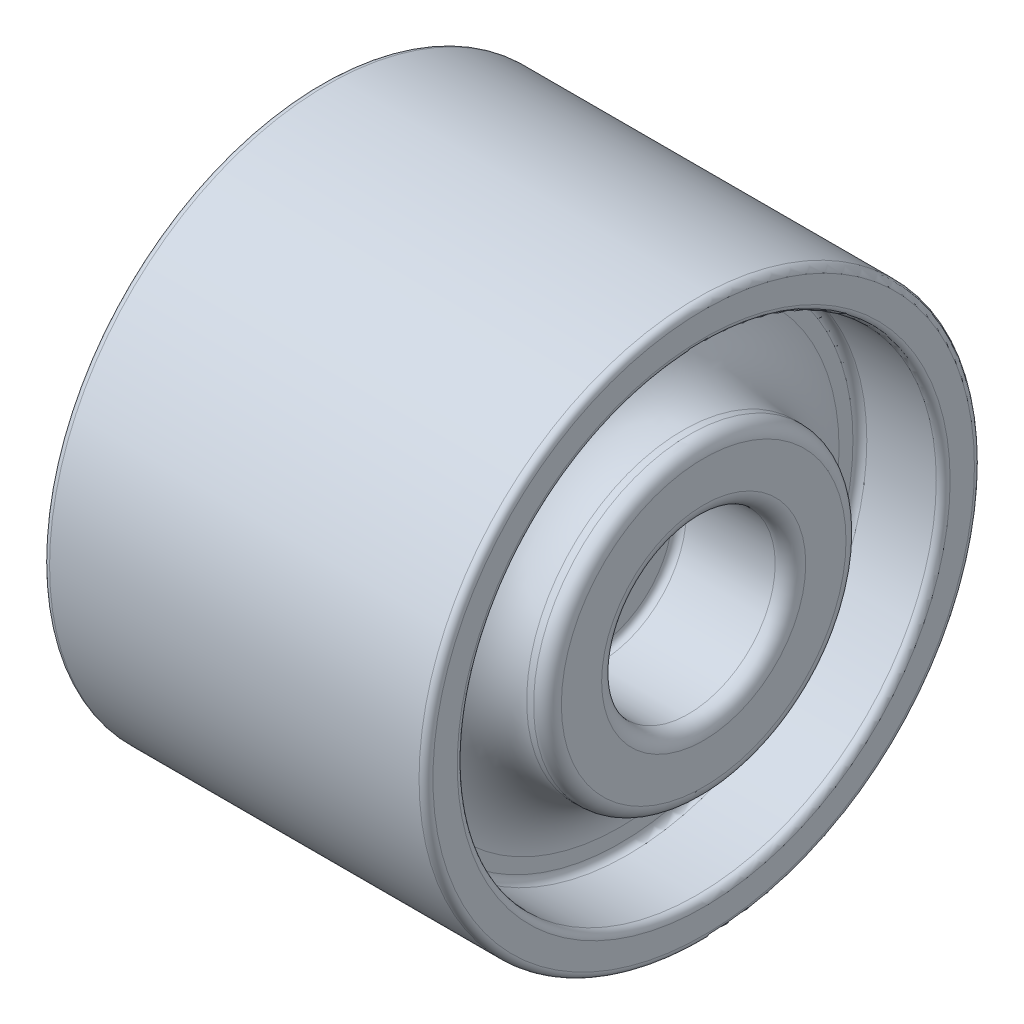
ISO-10303-21;
HEADER;
FILE_DESCRIPTION(('STEP AP214'),'2;1');
FILE_NAME('part.step','',(''),(''),'','','');
FILE_SCHEMA(('AUTOMOTIVE_DESIGN { 1 0 10303 214 1 1 1 1 }'));
ENDSEC;
DATA;
#1=APPLICATION_CONTEXT('core data for automotive mechanical design processes');
#2=APPLICATION_PROTOCOL_DEFINITION('international standard','automotive_design',2000,#1);
#3=PRODUCT_CONTEXT('',#1,'mechanical');
#4=PRODUCT('Part','Part','',(#3));
#5=PRODUCT_RELATED_PRODUCT_CATEGORY('part','',(#4));
#6=PRODUCT_DEFINITION_FORMATION('','',#4);
#7=PRODUCT_DEFINITION_CONTEXT('part definition',#1,'design');
#8=PRODUCT_DEFINITION('design','',#6,#7);
#9=PRODUCT_DEFINITION_SHAPE('','',#8);
#10=(LENGTH_UNIT() NAMED_UNIT(*) SI_UNIT(.MILLI.,.METRE.));
#11=(NAMED_UNIT(*) PLANE_ANGLE_UNIT() SI_UNIT($,.RADIAN.));
#12=(NAMED_UNIT(*) SI_UNIT($,.STERADIAN.) SOLID_ANGLE_UNIT());
#13=UNCERTAINTY_MEASURE_WITH_UNIT(LENGTH_MEASURE(1.E-05),#10,'distance_accuracy_value','');
#14=(GEOMETRIC_REPRESENTATION_CONTEXT(3) GLOBAL_UNCERTAINTY_ASSIGNED_CONTEXT((#13)) GLOBAL_UNIT_ASSIGNED_CONTEXT((#10,
#11,#12)) REPRESENTATION_CONTEXT('',''));
#15=CARTESIAN_POINT('',(0.,0.,0.));
#16=DIRECTION('',(0.,0.,1.));
#17=DIRECTION('',(1.,0.,0.));
#18=AXIS2_PLACEMENT_3D('',#15,#16,#17);
#19=CARTESIAN_POINT('',(-220.,0.,0.));
#20=DIRECTION('',(-1.,0.,0.));
#21=DIRECTION('',(0.,0.,1.));
#22=AXIS2_PLACEMENT_3D('',#19,#20,#21);
#23=CYLINDRICAL_SURFACE('',#22,400.);
#24=CARTESIAN_POINT('',(270.,0.,0.));
#25=DIRECTION('',(1.,0.,0.));
#26=DIRECTION('',(0.,0.,-1.));
#27=AXIS2_PLACEMENT_3D('',#24,#25,#26);
#28=CIRCLE('',#27,400.);
#29=CARTESIAN_POINT('',(270.,0.,-400.));
#30=VERTEX_POINT('',#29);
#31=EDGE_CURVE('E103',#30,#30,#28,.F.);
#32=ORIENTED_EDGE('',*,*,#31,.T.);
#33=EDGE_LOOP('',(#32));
#34=FACE_BOUND('',#33,.T.);
#35=CARTESIAN_POINT('',(-262.192235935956,0.,0.));
#36=DIRECTION('',(-1.,0.,0.));
#37=DIRECTION('',(0.,0.,1.));
#38=AXIS2_PLACEMENT_3D('',#35,#36,#37);
#39=CIRCLE('',#38,400.);
#40=CARTESIAN_POINT('',(-262.192235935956,0.,400.));
#41=VERTEX_POINT('',#40);
#42=EDGE_CURVE('E115',#41,#41,#39,.F.);
#43=ORIENTED_EDGE('',*,*,#42,.T.);
#44=EDGE_LOOP('',(#43));
#45=FACE_BOUND('',#44,.T.);
#46=ADVANCED_FACE('F47',(#34,#45),#23,.T.);
#47=CARTESIAN_POINT('',(-220.,0.,0.));
#48=DIRECTION('',(-1.,0.,0.));
#49=DIRECTION('',(0.,0.,1.));
#50=AXIS2_PLACEMENT_3D('',#47,#48,#49);
#51=CYLINDRICAL_SURFACE('',#50,340.);
#52=CARTESIAN_POINT('',(-260.,0.,0.));
#53=DIRECTION('',(1.,0.,0.));
#54=DIRECTION('',(0.,0.,-1.));
#55=AXIS2_PLACEMENT_3D('',#52,#53,#54);
#56=CIRCLE('',#55,340.);
#57=CARTESIAN_POINT('',(-260.,0.,-340.));
#58=VERTEX_POINT('',#57);
#59=EDGE_CURVE('E119',#58,#58,#56,.F.);
#60=ORIENTED_EDGE('',*,*,#59,.T.);
#61=EDGE_LOOP('',(#60));
#62=FACE_BOUND('',#61,.T.);
#63=CARTESIAN_POINT('',(-135.,0.,0.));
#64=DIRECTION('',(-1.,0.,0.));
#65=DIRECTION('',(0.,0.,1.));
#66=AXIS2_PLACEMENT_3D('',#63,#64,#65);
#67=CIRCLE('',#66,340.);
#68=CARTESIAN_POINT('',(-135.,0.,340.));
#69=VERTEX_POINT('',#68);
#70=EDGE_CURVE('E135',#69,#69,#67,.T.);
#71=ORIENTED_EDGE('',*,*,#70,.F.);
#72=EDGE_LOOP('',(#71));
#73=FACE_BOUND('',#72,.T.);
#74=ADVANCED_FACE('F149',(#62,#73),#51,.F.);
#75=CARTESIAN_POINT('',(-135.,340.,0.));
#76=DIRECTION('',(1.,0.,0.));
#77=DIRECTION('',(0.,0.,-1.));
#78=AXIS2_PLACEMENT_3D('',#75,#76,#77);
#79=PLANE('',#78);
#80=CARTESIAN_POINT('',(-135.,0.,0.));
#81=DIRECTION('',(-1.,0.,0.));
#82=DIRECTION('',(0.,0.,1.));
#83=AXIS2_PLACEMENT_3D('',#80,#81,#82);
#84=CIRCLE('',#83,140.);
#85=CARTESIAN_POINT('',(-135.,0.,140.));
#86=VERTEX_POINT('',#85);
#87=EDGE_CURVE('E139',#86,#86,#84,.T.);
#88=ORIENTED_EDGE('',*,*,#87,.F.);
#89=EDGE_LOOP('',(#88));
#90=FACE_BOUND('',#89,.T.);
#91=ORIENTED_EDGE('',*,*,#70,.T.);
#92=EDGE_LOOP('',(#91));
#93=FACE_BOUND('',#92,.T.);
#94=ADVANCED_FACE('F146',(#90,#93),#79,.F.);
#95=CARTESIAN_POINT('',(-220.,0.,0.));
#96=DIRECTION('',(-1.,0.,0.));
#97=DIRECTION('',(0.,0.,1.));
#98=AXIS2_PLACEMENT_3D('',#95,#96,#97);
#99=CYLINDRICAL_SURFACE('',#98,140.);
#100=CARTESIAN_POINT('',(-200.,0.,0.));
#101=DIRECTION('',(1.,0.,0.));
#102=DIRECTION('',(0.,0.,-1.));
#103=AXIS2_PLACEMENT_3D('',#100,#101,#102);
#104=CIRCLE('',#103,140.);
#105=CARTESIAN_POINT('',(-200.,0.,-140.));
#106=VERTEX_POINT('',#105);
#107=EDGE_CURVE('E123',#106,#106,#104,.T.);
#108=ORIENTED_EDGE('',*,*,#107,.T.);
#109=EDGE_LOOP('',(#108));
#110=FACE_BOUND('',#109,.T.);
#111=ORIENTED_EDGE('',*,*,#87,.T.);
#112=EDGE_LOOP('',(#111));
#113=FACE_BOUND('',#112,.T.);
#114=ADVANCED_FACE('F144',(#110,#113),#99,.T.);
#115=CARTESIAN_POINT('',(494.999999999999,0.,0.));
#116=DIRECTION('',(0.,0.,1.));
#117=DIRECTION('',(1.,0.,0.));
#118=AXIS2_PLACEMENT_3D('',#115,#116,#117);
#119=SPHERICAL_SURFACE('',#118,725.);
#120=CARTESIAN_POINT('',(494.999999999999,0.,0.));
#121=DIRECTION('',(1.,0.,0.));
#122=DIRECTION('',(0.,0.,-1.));
#123=AXIS2_PLACEMENT_3D('',#120,#121,#122);
#124=SPHERICAL_SURFACE('',#123,725.);
#125=CARTESIAN_POINT('',(-220.,0.,0.));
#126=DIRECTION('',(1.,0.,0.));
#127=DIRECTION('',(0.,0.,-1.));
#128=AXIS2_PLACEMENT_3D('',#125,#126,#127);
#129=CIRCLE('',#128,120.);
#130=CARTESIAN_POINT('',(-220.,0.,-120.));
#131=VERTEX_POINT('',#130);
#132=EDGE_CURVE('E124',#131,#131,#129,.F.);
#133=ORIENTED_EDGE('',*,*,#132,.T.);
#134=EDGE_LOOP('',(#133));
#135=FACE_BOUND('',#134,.T.);
#136=ADVANCED_FACE('F172',(#135),#124,.T.);
#137=CARTESIAN_POINT('',(-280.,0.,0.));
#138=DIRECTION('',(1.,0.,0.));
#139=DIRECTION('',(0.,0.,-1.));
#140=AXIS2_PLACEMENT_3D('',#137,#138,#139);
#141=CONICAL_SURFACE('',#140,360.,1.32581766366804);
#142=CARTESIAN_POINT('',(-271.893660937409,0.,0.));
#143=DIRECTION('',(1.,0.,0.));
#144=DIRECTION('',(0.,0.,-1.));
#145=AXIS2_PLACEMENT_3D('',#142,#143,#144);
#146=CIRCLE('',#145,392.425356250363);
#147=CARTESIAN_POINT('',(-271.893660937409,0.,-392.425356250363));
#148=VERTEX_POINT('',#147);
#149=EDGE_CURVE('E111',#148,#148,#146,.F.);
#150=ORIENTED_EDGE('',*,*,#149,.T.);
#151=EDGE_LOOP('',(#150));
#152=FACE_BOUND('',#151,.T.);
#153=CARTESIAN_POINT('',(-280.,0.,0.));
#154=DIRECTION('',(1.,0.,0.));
#155=DIRECTION('',(0.,0.,-1.));
#156=AXIS2_PLACEMENT_3D('',#153,#154,#155);
#157=CIRCLE('',#156,360.);
#158=CARTESIAN_POINT('',(-280.,0.,-360.));
#159=VERTEX_POINT('',#158);
#160=EDGE_CURVE('E128',#159,#159,#157,.F.);
#161=ORIENTED_EDGE('',*,*,#160,.F.);
#162=EDGE_LOOP('',(#161));
#163=FACE_BOUND('',#162,.T.);
#164=ADVANCED_FACE('F166',(#152,#163),#141,.T.);
#165=CARTESIAN_POINT('',(-200.,0.,0.));
#166=DIRECTION('',(1.,0.,0.));
#167=DIRECTION('',(0.,0.,-1.));
#168=AXIS2_PLACEMENT_3D('',#165,#166,#167);
#169=TOROIDAL_SURFACE('',#168,120.,20.);
#170=ORIENTED_EDGE('',*,*,#107,.F.);
#171=EDGE_LOOP('',(#170));
#172=FACE_BOUND('',#171,.T.);
#173=ORIENTED_EDGE('',*,*,#132,.F.);
#174=EDGE_LOOP('',(#173));
#175=FACE_BOUND('',#174,.T.);
#176=ADVANCED_FACE('F171',(#172,#175),#169,.T.);
#177=CARTESIAN_POINT('',(280.,0.,0.));
#178=DIRECTION('',(1.,0.,0.));
#179=DIRECTION('',(0.,0.,-1.));
#180=AXIS2_PLACEMENT_3D('',#177,#178,#179);
#181=PLANE('',#180);
#182=CARTESIAN_POINT('',(280.,0.,0.));
#183=DIRECTION('',(1.,0.,0.));
#184=DIRECTION('',(0.,0.,-1.));
#185=AXIS2_PLACEMENT_3D('',#182,#183,#184);
#186=CIRCLE('',#185,355.);
#187=CARTESIAN_POINT('',(280.,0.,-355.));
#188=VERTEX_POINT('',#187);
#189=EDGE_CURVE('E87',#188,#188,#186,.F.);
#190=ORIENTED_EDGE('',*,*,#189,.T.);
#191=EDGE_LOOP('',(#190));
#192=FACE_BOUND('',#191,.T.);
#193=CARTESIAN_POINT('',(280.,0.,0.));
#194=DIRECTION('',(1.,0.,0.));
#195=DIRECTION('',(0.,0.,-1.));
#196=AXIS2_PLACEMENT_3D('',#193,#194,#195);
#197=CIRCLE('',#196,390.);
#198=CARTESIAN_POINT('',(280.,0.,-390.));
#199=VERTEX_POINT('',#198);
#200=EDGE_CURVE('E107',#199,#199,#197,.T.);
#201=ORIENTED_EDGE('',*,*,#200,.T.);
#202=EDGE_LOOP('',(#201));
#203=FACE_BOUND('',#202,.T.);
#204=ADVANCED_FACE('F175',(#192,#203),#181,.T.);
#205=CARTESIAN_POINT('',(160.,0.,0.));
#206=DIRECTION('',(1.,0.,0.));
#207=DIRECTION('',(0.,0.,-1.));
#208=AXIS2_PLACEMENT_3D('',#205,#206,#207);
#209=CYLINDRICAL_SURFACE('',#208,345.);
#210=CARTESIAN_POINT('',(270.,0.,0.));
#211=DIRECTION('',(1.,0.,0.));
#212=DIRECTION('',(0.,0.,-1.));
#213=AXIS2_PLACEMENT_3D('',#210,#211,#212);
#214=CIRCLE('',#213,345.);
#215=CARTESIAN_POINT('',(270.,0.,-345.));
#216=VERTEX_POINT('',#215);
#217=EDGE_CURVE('E91',#216,#216,#214,.T.);
#218=ORIENTED_EDGE('',*,*,#217,.T.);
#219=EDGE_LOOP('',(#218));
#220=FACE_BOUND('',#219,.T.);
#221=CARTESIAN_POINT('',(170.,0.,0.));
#222=DIRECTION('',(1.,0.,0.));
#223=DIRECTION('',(0.,0.,-1.));
#224=AXIS2_PLACEMENT_3D('',#221,#222,#223);
#225=CIRCLE('',#224,345.);
#226=CARTESIAN_POINT('',(170.,0.,-345.));
#227=VERTEX_POINT('',#226);
#228=EDGE_CURVE('E95',#227,#227,#225,.F.);
#229=ORIENTED_EDGE('',*,*,#228,.T.);
#230=EDGE_LOOP('',(#229));
#231=FACE_BOUND('',#230,.T.);
#232=ADVANCED_FACE('F238',(#220,#231),#209,.F.);
#233=CARTESIAN_POINT('',(160.,0.,0.));
#234=DIRECTION('',(1.,0.,0.));
#235=DIRECTION('',(0.,0.,-1.));
#236=AXIS2_PLACEMENT_3D('',#233,#234,#235);
#237=PLANE('',#236);
#238=CARTESIAN_POINT('',(160.,0.,0.));
#239=DIRECTION('',(1.,0.,0.));
#240=DIRECTION('',(0.,0.,-1.));
#241=AXIS2_PLACEMENT_3D('',#238,#239,#240);
#242=CIRCLE('',#241,315.);
#243=CARTESIAN_POINT('',(160.,0.,-315.));
#244=VERTEX_POINT('',#243);
#245=EDGE_CURVE('E10',#244,#244,#242,.F.);
#246=ORIENTED_EDGE('',*,*,#245,.T.);
#247=EDGE_LOOP('',(#246));
#248=FACE_BOUND('',#247,.T.);
#249=CARTESIAN_POINT('',(160.,0.,0.));
#250=DIRECTION('',(1.,0.,0.));
#251=DIRECTION('',(0.,0.,-1.));
#252=AXIS2_PLACEMENT_3D('',#249,#250,#251);
#253=CIRCLE('',#252,335.);
#254=CARTESIAN_POINT('',(160.,0.,-335.));
#255=VERTEX_POINT('',#254);
#256=EDGE_CURVE('E99',#255,#255,#253,.T.);
#257=ORIENTED_EDGE('',*,*,#256,.T.);
#258=EDGE_LOOP('',(#257));
#259=FACE_BOUND('',#258,.T.);
#260=ADVANCED_FACE('F236',(#248,#259),#237,.T.);
#261=CARTESIAN_POINT('',(160.,0.,0.));
#262=DIRECTION('',(1.,0.,0.));
#263=DIRECTION('',(0.,0.,-1.));
#264=AXIS2_PLACEMENT_3D('',#261,#262,#263);
#265=CYLINDRICAL_SURFACE('',#264,225.);
#266=CARTESIAN_POINT('',(250.,0.,0.));
#267=DIRECTION('',(1.,0.,0.));
#268=DIRECTION('',(0.,0.,-1.));
#269=AXIS2_PLACEMENT_3D('',#266,#267,#268);
#270=CIRCLE('',#269,225.);
#271=CARTESIAN_POINT('',(250.,0.,-225.));
#272=VERTEX_POINT('',#271);
#273=EDGE_CURVE('E55',#272,#272,#270,.T.);
#274=ORIENTED_EDGE('',*,*,#273,.T.);
#275=EDGE_LOOP('',(#274));
#276=FACE_BOUND('',#275,.T.);
#277=CARTESIAN_POINT('',(260.,0.,0.));
#278=DIRECTION('',(1.,0.,0.));
#279=DIRECTION('',(0.,0.,-1.));
#280=AXIS2_PLACEMENT_3D('',#277,#278,#279);
#281=CIRCLE('',#280,225.);
#282=CARTESIAN_POINT('',(260.,0.,-225.));
#283=VERTEX_POINT('',#282);
#284=EDGE_CURVE('E79',#283,#283,#281,.F.);
#285=ORIENTED_EDGE('',*,*,#284,.T.);
#286=EDGE_LOOP('',(#285));
#287=FACE_BOUND('',#286,.T.);
#288=ADVANCED_FACE('F233',(#276,#287),#265,.T.);
#289=CARTESIAN_POINT('',(280.,0.,0.));
#290=DIRECTION('',(1.,0.,0.));
#291=DIRECTION('',(0.,0.,-1.));
#292=AXIS2_PLACEMENT_3D('',#289,#290,#291);
#293=CIRCLE('',#292,147.);
#294=CARTESIAN_POINT('',(280.,0.,-147.));
#295=VERTEX_POINT('',#294);
#296=EDGE_CURVE('E60',#295,#295,#293,.F.);
#297=ORIENTED_EDGE('',*,*,#296,.T.);
#298=EDGE_LOOP('',(#297));
#299=FACE_BOUND('',#298,.T.);
#300=CARTESIAN_POINT('',(280.,0.,0.));
#301=DIRECTION('',(1.,0.,0.));
#302=DIRECTION('',(0.,0.,-1.));
#303=AXIS2_PLACEMENT_3D('',#300,#301,#302);
#304=CIRCLE('',#303,205.);
#305=CARTESIAN_POINT('',(280.,0.,-205.));
#306=VERTEX_POINT('',#305);
#307=EDGE_CURVE('E83',#306,#306,#304,.T.);
#308=ORIENTED_EDGE('',*,*,#307,.T.);
#309=EDGE_LOOP('',(#308));
#310=FACE_BOUND('',#309,.T.);
#311=ADVANCED_FACE('F183',(#299,#310),#181,.T.);
#312=CARTESIAN_POINT('',(-260.,0.,0.));
#313=DIRECTION('',(1.,0.,0.));
#314=DIRECTION('',(0.,0.,-1.));
#315=AXIS2_PLACEMENT_3D('',#312,#313,#314);
#316=TOROIDAL_SURFACE('',#315,360.,20.);
#317=ORIENTED_EDGE('',*,*,#160,.T.);
#318=EDGE_LOOP('',(#317));
#319=FACE_BOUND('',#318,.T.);
#320=ORIENTED_EDGE('',*,*,#59,.F.);
#321=EDGE_LOOP('',(#320));
#322=FACE_BOUND('',#321,.T.);
#323=ADVANCED_FACE('F180',(#319,#322),#316,.T.);
#324=CARTESIAN_POINT('',(-262.192235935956,0.,0.));
#325=DIRECTION('',(-1.,0.,0.));
#326=DIRECTION('',(0.,0.,1.));
#327=AXIS2_PLACEMENT_3D('',#324,#325,#326);
#328=TOROIDAL_SURFACE('',#327,390.,10.);
#329=ORIENTED_EDGE('',*,*,#149,.F.);
#330=EDGE_LOOP('',(#329));
#331=FACE_BOUND('',#330,.T.);
#332=ORIENTED_EDGE('',*,*,#42,.F.);
#333=EDGE_LOOP('',(#332));
#334=FACE_BOUND('',#333,.T.);
#335=ADVANCED_FACE('F182',(#331,#334),#328,.T.);
#336=CARTESIAN_POINT('',(270.,0.,0.));
#337=DIRECTION('',(1.,0.,0.));
#338=DIRECTION('',(0.,0.,-1.));
#339=AXIS2_PLACEMENT_3D('',#336,#337,#338);
#340=TOROIDAL_SURFACE('',#339,390.,10.);
#341=ORIENTED_EDGE('',*,*,#31,.F.);
#342=EDGE_LOOP('',(#341));
#343=FACE_BOUND('',#342,.T.);
#344=ORIENTED_EDGE('',*,*,#200,.F.);
#345=EDGE_LOOP('',(#344));
#346=FACE_BOUND('',#345,.T.);
#347=ADVANCED_FACE('F187',(#343,#346),#340,.T.);
#348=CARTESIAN_POINT('',(170.,0.,0.));
#349=DIRECTION('',(1.,0.,0.));
#350=DIRECTION('',(0.,0.,-1.));
#351=AXIS2_PLACEMENT_3D('',#348,#349,#350);
#352=TOROIDAL_SURFACE('',#351,335.,10.);
#353=ORIENTED_EDGE('',*,*,#228,.F.);
#354=EDGE_LOOP('',(#353));
#355=FACE_BOUND('',#354,.T.);
#356=ORIENTED_EDGE('',*,*,#256,.F.);
#357=EDGE_LOOP('',(#356));
#358=FACE_BOUND('',#357,.T.);
#359=ADVANCED_FACE('F191',(#355,#358),#352,.F.);
#360=CARTESIAN_POINT('',(270.,0.,0.));
#361=DIRECTION('',(1.,0.,0.));
#362=DIRECTION('',(0.,0.,-1.));
#363=AXIS2_PLACEMENT_3D('',#360,#361,#362);
#364=TOROIDAL_SURFACE('',#363,355.,10.);
#365=ORIENTED_EDGE('',*,*,#189,.F.);
#366=EDGE_LOOP('',(#365));
#367=FACE_BOUND('',#366,.T.);
#368=ORIENTED_EDGE('',*,*,#217,.F.);
#369=EDGE_LOOP('',(#368));
#370=FACE_BOUND('',#369,.T.);
#371=ADVANCED_FACE('F195',(#367,#370),#364,.T.);
#372=CARTESIAN_POINT('',(260.,0.,0.));
#373=DIRECTION('',(1.,0.,0.));
#374=DIRECTION('',(0.,0.,-1.));
#375=AXIS2_PLACEMENT_3D('',#372,#373,#374);
#376=TOROIDAL_SURFACE('',#375,205.,20.);
#377=ORIENTED_EDGE('',*,*,#284,.F.);
#378=EDGE_LOOP('',(#377));
#379=FACE_BOUND('',#378,.T.);
#380=ORIENTED_EDGE('',*,*,#307,.F.);
#381=EDGE_LOOP('',(#380));
#382=FACE_BOUND('',#381,.T.);
#383=ADVANCED_FACE('F199',(#379,#382),#376,.T.);
#384=CARTESIAN_POINT('',(120.,0.,0.));
#385=DIRECTION('',(1.,0.,0.));
#386=DIRECTION('',(0.,0.,-1.));
#387=AXIS2_PLACEMENT_3D('',#384,#385,#386);
#388=CYLINDRICAL_SURFACE('',#387,125.);
#389=CARTESIAN_POINT('',(258.,0.,0.));
#390=DIRECTION('',(1.,0.,0.));
#391=DIRECTION('',(0.,0.,-1.));
#392=AXIS2_PLACEMENT_3D('',#389,#390,#391);
#393=CIRCLE('',#392,125.);
#394=CARTESIAN_POINT('',(258.,0.,-125.));
#395=VERTEX_POINT('',#394);
#396=EDGE_CURVE('E65',#395,#395,#393,.T.);
#397=ORIENTED_EDGE('',*,*,#396,.T.);
#398=EDGE_LOOP('',(#397));
#399=FACE_BOUND('',#398,.T.);
#400=CARTESIAN_POINT('',(130.,0.,0.));
#401=DIRECTION('',(1.,0.,0.));
#402=DIRECTION('',(0.,0.,-1.));
#403=AXIS2_PLACEMENT_3D('',#400,#401,#402);
#404=CIRCLE('',#403,125.);
#405=CARTESIAN_POINT('',(130.,0.,-125.));
#406=VERTEX_POINT('',#405);
#407=EDGE_CURVE('E71',#406,#406,#404,.F.);
#408=ORIENTED_EDGE('',*,*,#407,.T.);
#409=EDGE_LOOP('',(#408));
#410=FACE_BOUND('',#409,.T.);
#411=ADVANCED_FACE('F203',(#399,#410),#388,.F.);
#412=CARTESIAN_POINT('',(120.,0.,0.));
#413=DIRECTION('',(1.,0.,0.));
#414=DIRECTION('',(0.,0.,-1.));
#415=AXIS2_PLACEMENT_3D('',#412,#413,#414);
#416=PLANE('',#415);
#417=CARTESIAN_POINT('',(120.,0.,0.));
#418=DIRECTION('',(1.,0.,0.));
#419=DIRECTION('',(0.,0.,-1.));
#420=AXIS2_PLACEMENT_3D('',#417,#418,#419);
#421=CIRCLE('',#420,115.);
#422=CARTESIAN_POINT('',(120.,0.,-115.));
#423=VERTEX_POINT('',#422);
#424=EDGE_CURVE('E75',#423,#423,#421,.T.);
#425=ORIENTED_EDGE('',*,*,#424,.T.);
#426=EDGE_LOOP('',(#425));
#427=FACE_BOUND('',#426,.T.);
#428=ADVANCED_FACE('F208',(#427),#416,.T.);
#429=CARTESIAN_POINT('',(130.,0.,0.));
#430=DIRECTION('',(1.,0.,0.));
#431=DIRECTION('',(0.,0.,-1.));
#432=AXIS2_PLACEMENT_3D('',#429,#430,#431);
#433=TOROIDAL_SURFACE('',#432,115.,10.);
#434=ORIENTED_EDGE('',*,*,#407,.F.);
#435=EDGE_LOOP('',(#434));
#436=FACE_BOUND('',#435,.T.);
#437=ORIENTED_EDGE('',*,*,#424,.F.);
#438=EDGE_LOOP('',(#437));
#439=FACE_BOUND('',#438,.T.);
#440=ADVANCED_FACE('F205',(#436,#439),#433,.F.);
#441=CARTESIAN_POINT('',(258.,0.,0.));
#442=DIRECTION('',(1.,0.,0.));
#443=DIRECTION('',(0.,0.,-1.));
#444=AXIS2_PLACEMENT_3D('',#441,#442,#443);
#445=TOROIDAL_SURFACE('',#444,147.,22.);
#446=ORIENTED_EDGE('',*,*,#296,.F.);
#447=EDGE_LOOP('',(#446));
#448=FACE_BOUND('',#447,.T.);
#449=ORIENTED_EDGE('',*,*,#396,.F.);
#450=EDGE_LOOP('',(#449));
#451=FACE_BOUND('',#450,.T.);
#452=ADVANCED_FACE('F207',(#448,#451),#445,.T.);
#453=CARTESIAN_POINT('',(250.,0.,0.));
#454=DIRECTION('',(1.,0.,0.));
#455=DIRECTION('',(0.,0.,-1.));
#456=AXIS2_PLACEMENT_3D('',#453,#454,#455);
#457=TOROIDAL_SURFACE('',#456,315.,90.);
#458=ORIENTED_EDGE('',*,*,#245,.F.);
#459=EDGE_LOOP('',(#458));
#460=FACE_BOUND('',#459,.T.);
#461=ORIENTED_EDGE('',*,*,#273,.F.);
#462=EDGE_LOOP('',(#461));
#463=FACE_BOUND('',#462,.T.);
#464=ADVANCED_FACE('F49',(#460,#463),#457,.F.);
#465=CLOSED_SHELL('',(#46,#74,#94,#114,#136,#164,#176,#204,#232,#260,#288,#311,#323,#335,#347,
#359,#371,#383,#411,#428,#440,#452,#464));
#466=MANIFOLD_SOLID_BREP('B2',#465);
#467=ADVANCED_BREP_SHAPE_REPRESENTATION('',(#18,#466),#14);
#468=SHAPE_DEFINITION_REPRESENTATION(#9,#467);
ENDSEC;
END-ISO-10303-21;
